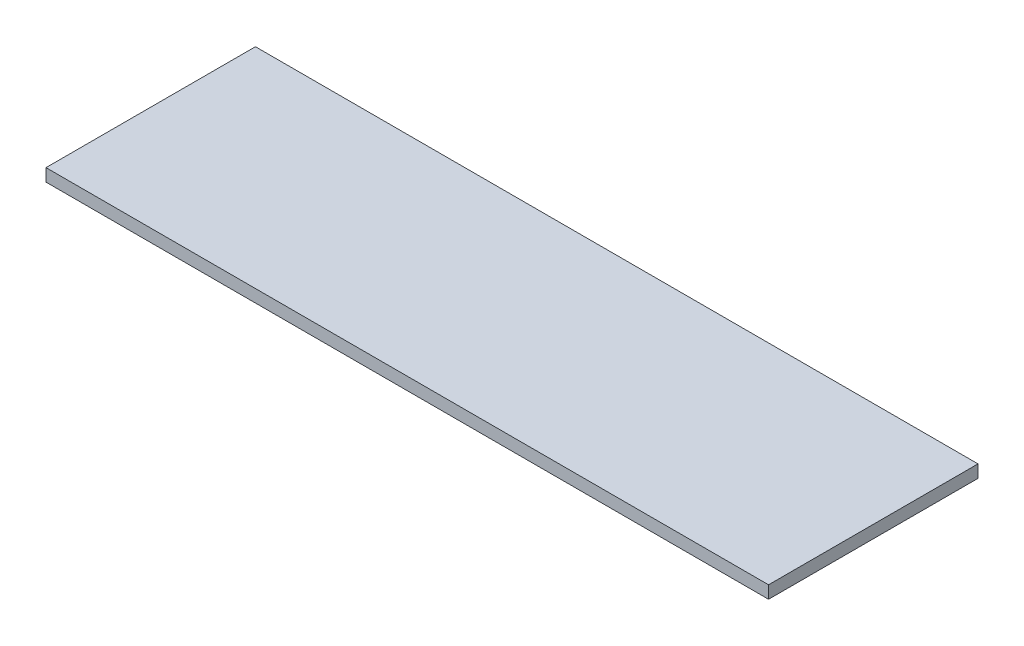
ISO-10303-21;
HEADER;
FILE_DESCRIPTION(('STEP AP214'),'2;1');
FILE_NAME('part.step','',(''),(''),'','','');
FILE_SCHEMA(('AUTOMOTIVE_DESIGN { 1 0 10303 214 1 1 1 1 }'));
ENDSEC;
DATA;
#1=APPLICATION_CONTEXT('core data for automotive mechanical design processes');
#2=APPLICATION_PROTOCOL_DEFINITION('international standard','automotive_design',2000,#1);
#3=PRODUCT_CONTEXT('',#1,'mechanical');
#4=PRODUCT('Part','Part','',(#3));
#5=PRODUCT_RELATED_PRODUCT_CATEGORY('part','',(#4));
#6=PRODUCT_DEFINITION_FORMATION('','',#4);
#7=PRODUCT_DEFINITION_CONTEXT('part definition',#1,'design');
#8=PRODUCT_DEFINITION('design','',#6,#7);
#9=PRODUCT_DEFINITION_SHAPE('','',#8);
#10=(LENGTH_UNIT() NAMED_UNIT(*) SI_UNIT(.MILLI.,.METRE.));
#11=(NAMED_UNIT(*) PLANE_ANGLE_UNIT() SI_UNIT($,.RADIAN.));
#12=(NAMED_UNIT(*) SI_UNIT($,.STERADIAN.) SOLID_ANGLE_UNIT());
#13=UNCERTAINTY_MEASURE_WITH_UNIT(LENGTH_MEASURE(1.E-05),#10,'distance_accuracy_value','');
#14=(GEOMETRIC_REPRESENTATION_CONTEXT(3) GLOBAL_UNCERTAINTY_ASSIGNED_CONTEXT((#13)) GLOBAL_UNIT_ASSIGNED_CONTEXT((#10,
#11,#12)) REPRESENTATION_CONTEXT('',''));
#15=CARTESIAN_POINT('',(0.,0.,0.));
#16=DIRECTION('',(0.,0.,1.));
#17=DIRECTION('',(1.,0.,0.));
#18=AXIS2_PLACEMENT_3D('',#15,#16,#17);
#19=CARTESIAN_POINT('',(345.,12.,-100.));
#20=DIRECTION('',(-1.,0.,0.));
#21=DIRECTION('',(0.,0.,1.));
#22=AXIS2_PLACEMENT_3D('',#19,#20,#21);
#23=PLANE('',#22);
#24=DIRECTION('',(0.,0.,-1.));
#25=VECTOR('',#24,1.);
#26=CARTESIAN_POINT('',(345.,0.,-100.));
#27=LINE('',#26,#25);
#28=CARTESIAN_POINT('',(345.,0.,100.));
#29=VERTEX_POINT('',#28);
#30=CARTESIAN_POINT('',(345.,0.,-100.));
#31=VERTEX_POINT('',#30);
#32=EDGE_CURVE('E96',#29,#31,#27,.T.);
#33=ORIENTED_EDGE('',*,*,#32,.T.);
#34=DIRECTION('',(0.,-1.,0.));
#35=VECTOR('',#34,1.);
#36=CARTESIAN_POINT('',(345.,12.,-100.));
#37=LINE('',#36,#35);
#38=CARTESIAN_POINT('',(345.,12.,-100.));
#39=VERTEX_POINT('',#38);
#40=EDGE_CURVE('E11',#39,#31,#37,.T.);
#41=ORIENTED_EDGE('',*,*,#40,.F.);
#42=DIRECTION('',(0.,0.,-1.));
#43=VECTOR('',#42,1.);
#44=CARTESIAN_POINT('',(345.,12.,-100.));
#45=LINE('',#44,#43);
#46=CARTESIAN_POINT('',(345.,12.,100.));
#47=VERTEX_POINT('',#46);
#48=EDGE_CURVE('E84',#47,#39,#45,.T.);
#49=ORIENTED_EDGE('',*,*,#48,.F.);
#50=DIRECTION('',(0.,-1.,0.));
#51=VECTOR('',#50,1.);
#52=CARTESIAN_POINT('',(345.,12.,100.));
#53=LINE('',#52,#51);
#54=EDGE_CURVE('E92',#47,#29,#53,.T.);
#55=ORIENTED_EDGE('',*,*,#54,.T.);
#56=EDGE_LOOP('',(#33,#41,#49,#55));
#57=FACE_BOUND('',#56,.T.);
#58=ADVANCED_FACE('F33',(#57),#23,.F.);
#59=CARTESIAN_POINT('',(-345.,12.,-100.));
#60=DIRECTION('',(0.,0.,1.));
#61=DIRECTION('',(1.,0.,0.));
#62=AXIS2_PLACEMENT_3D('',#59,#60,#61);
#63=PLANE('',#62);
#64=DIRECTION('',(-1.,0.,0.));
#65=VECTOR('',#64,1.);
#66=CARTESIAN_POINT('',(-345.,0.,-100.));
#67=LINE('',#66,#65);
#68=CARTESIAN_POINT('',(-345.,0.,-100.));
#69=VERTEX_POINT('',#68);
#70=EDGE_CURVE('E88',#31,#69,#67,.T.);
#71=ORIENTED_EDGE('',*,*,#70,.T.);
#72=DIRECTION('',(0.,-1.,0.));
#73=VECTOR('',#72,1.);
#74=CARTESIAN_POINT('',(-345.,12.,-100.));
#75=LINE('',#74,#73);
#76=CARTESIAN_POINT('',(-345.,12.,-100.));
#77=VERTEX_POINT('',#76);
#78=EDGE_CURVE('E41',#77,#69,#75,.T.);
#79=ORIENTED_EDGE('',*,*,#78,.F.);
#80=DIRECTION('',(-1.,0.,0.));
#81=VECTOR('',#80,1.);
#82=CARTESIAN_POINT('',(-345.,12.,-100.));
#83=LINE('',#82,#81);
#84=EDGE_CURVE('E79',#39,#77,#83,.T.);
#85=ORIENTED_EDGE('',*,*,#84,.F.);
#86=ORIENTED_EDGE('',*,*,#40,.T.);
#87=EDGE_LOOP('',(#71,#79,#85,#86));
#88=FACE_BOUND('',#87,.T.);
#89=ADVANCED_FACE('F87',(#88),#63,.F.);
#90=CARTESIAN_POINT('',(-345.,12.,-100.));
#91=DIRECTION('',(1.,0.,0.));
#92=DIRECTION('',(0.,0.,-1.));
#93=AXIS2_PLACEMENT_3D('',#90,#91,#92);
#94=PLANE('',#93);
#95=DIRECTION('',(0.,0.,1.));
#96=VECTOR('',#95,1.);
#97=CARTESIAN_POINT('',(-345.,0.,-100.));
#98=LINE('',#97,#96);
#99=CARTESIAN_POINT('',(-345.,0.,100.));
#100=VERTEX_POINT('',#99);
#101=EDGE_CURVE('E66',#69,#100,#98,.T.);
#102=ORIENTED_EDGE('',*,*,#101,.T.);
#103=DIRECTION('',(0.,-1.,0.));
#104=VECTOR('',#103,1.);
#105=CARTESIAN_POINT('',(-345.,12.,100.));
#106=LINE('',#105,#104);
#107=CARTESIAN_POINT('',(-345.,12.,100.));
#108=VERTEX_POINT('',#107);
#109=EDGE_CURVE('E89',#108,#100,#106,.T.);
#110=ORIENTED_EDGE('',*,*,#109,.F.);
#111=DIRECTION('',(0.,0.,1.));
#112=VECTOR('',#111,1.);
#113=CARTESIAN_POINT('',(-345.,12.,-100.));
#114=LINE('',#113,#112);
#115=EDGE_CURVE('E82',#77,#108,#114,.T.);
#116=ORIENTED_EDGE('',*,*,#115,.F.);
#117=ORIENTED_EDGE('',*,*,#78,.T.);
#118=EDGE_LOOP('',(#102,#110,#116,#117));
#119=FACE_BOUND('',#118,.T.);
#120=ADVANCED_FACE('F90',(#119),#94,.F.);
#121=CARTESIAN_POINT('',(-345.,12.,100.));
#122=DIRECTION('',(0.,0.,-1.));
#123=DIRECTION('',(-1.,0.,0.));
#124=AXIS2_PLACEMENT_3D('',#121,#122,#123);
#125=PLANE('',#124);
#126=DIRECTION('',(1.,0.,0.));
#127=VECTOR('',#126,1.);
#128=CARTESIAN_POINT('',(-345.,0.,100.));
#129=LINE('',#128,#127);
#130=EDGE_CURVE('E72',#100,#29,#129,.T.);
#131=ORIENTED_EDGE('',*,*,#130,.T.);
#132=ORIENTED_EDGE('',*,*,#54,.F.);
#133=DIRECTION('',(1.,0.,0.));
#134=VECTOR('',#133,1.);
#135=CARTESIAN_POINT('',(-345.,12.,100.));
#136=LINE('',#135,#134);
#137=EDGE_CURVE('E49',#108,#47,#136,.T.);
#138=ORIENTED_EDGE('',*,*,#137,.F.);
#139=ORIENTED_EDGE('',*,*,#109,.T.);
#140=EDGE_LOOP('',(#131,#132,#138,#139));
#141=FACE_BOUND('',#140,.T.);
#142=ADVANCED_FACE('F103',(#141),#125,.F.);
#143=CARTESIAN_POINT('',(0.,12.,0.));
#144=DIRECTION('',(0.,1.,0.));
#145=DIRECTION('',(0.,0.,1.));
#146=AXIS2_PLACEMENT_3D('',#143,#144,#145);
#147=PLANE('',#146);
#148=ORIENTED_EDGE('',*,*,#48,.T.);
#149=ORIENTED_EDGE('',*,*,#84,.T.);
#150=ORIENTED_EDGE('',*,*,#115,.T.);
#151=ORIENTED_EDGE('',*,*,#137,.T.);
#152=EDGE_LOOP('',(#148,#149,#150,#151));
#153=FACE_BOUND('',#152,.T.);
#154=ADVANCED_FACE('F80',(#153),#147,.T.);
#155=CARTESIAN_POINT('',(0.,0.,0.));
#156=DIRECTION('',(0.,1.,0.));
#157=DIRECTION('',(0.,0.,1.));
#158=AXIS2_PLACEMENT_3D('',#155,#156,#157);
#159=PLANE('',#158);
#160=ORIENTED_EDGE('',*,*,#32,.F.);
#161=ORIENTED_EDGE('',*,*,#130,.F.);
#162=ORIENTED_EDGE('',*,*,#101,.F.);
#163=ORIENTED_EDGE('',*,*,#70,.F.);
#164=EDGE_LOOP('',(#160,#161,#162,#163));
#165=FACE_BOUND('',#164,.T.);
#166=ADVANCED_FACE('F106',(#165),#159,.F.);
#167=CLOSED_SHELL('',(#58,#89,#120,#142,#154,#166));
#168=MANIFOLD_SOLID_BREP('B2',#167);
#169=ADVANCED_BREP_SHAPE_REPRESENTATION('',(#18,#168),#14);
#170=SHAPE_DEFINITION_REPRESENTATION(#9,#169);
ENDSEC;
END-ISO-10303-21;
